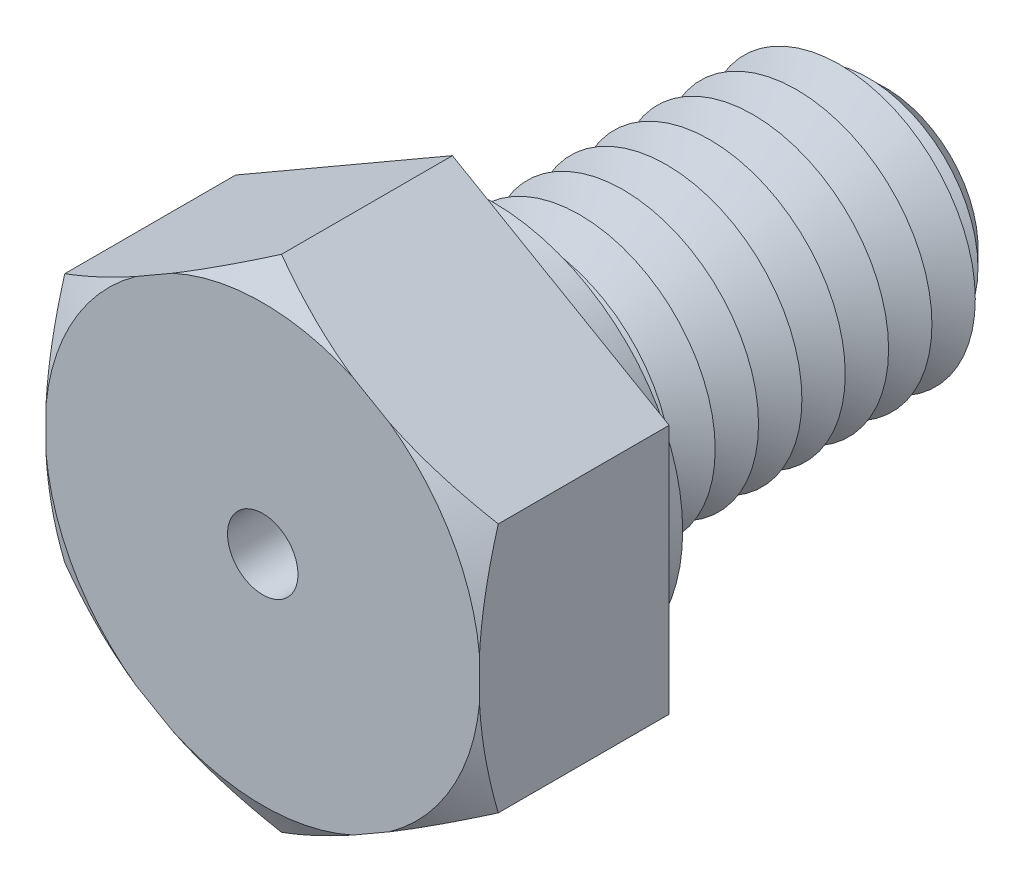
ISO-10303-21;
HEADER;
FILE_DESCRIPTION(('STEP AP214'),'2;1');
FILE_NAME('part.step','',(''),(''),'','','');
FILE_SCHEMA(('AUTOMOTIVE_DESIGN { 1 0 10303 214 1 1 1 1 }'));
ENDSEC;
DATA;
#1=APPLICATION_CONTEXT('core data for automotive mechanical design processes');
#2=APPLICATION_PROTOCOL_DEFINITION('international standard','automotive_design',2000,#1);
#3=PRODUCT_CONTEXT('',#1,'mechanical');
#4=PRODUCT('Part','Part','',(#3));
#5=PRODUCT_RELATED_PRODUCT_CATEGORY('part','',(#4));
#6=PRODUCT_DEFINITION_FORMATION('','',#4);
#7=PRODUCT_DEFINITION_CONTEXT('part definition',#1,'design');
#8=PRODUCT_DEFINITION('design','',#6,#7);
#9=PRODUCT_DEFINITION_SHAPE('','',#8);
#10=(LENGTH_UNIT() NAMED_UNIT(*) SI_UNIT(.MILLI.,.METRE.));
#11=(NAMED_UNIT(*) PLANE_ANGLE_UNIT() SI_UNIT($,.RADIAN.));
#12=(NAMED_UNIT(*) SI_UNIT($,.STERADIAN.) SOLID_ANGLE_UNIT());
#13=UNCERTAINTY_MEASURE_WITH_UNIT(LENGTH_MEASURE(1.E-05),#10,'distance_accuracy_value','');
#14=(GEOMETRIC_REPRESENTATION_CONTEXT(3) GLOBAL_UNCERTAINTY_ASSIGNED_CONTEXT((#13)) GLOBAL_UNIT_ASSIGNED_CONTEXT((#10,
#11,#12)) REPRESENTATION_CONTEXT('',''));
#15=CARTESIAN_POINT('',(0.,0.,0.));
#16=DIRECTION('',(0.,0.,1.));
#17=DIRECTION('',(1.,0.,0.));
#18=AXIS2_PLACEMENT_3D('',#15,#16,#17);
#19=CARTESIAN_POINT('',(4.,2.3094010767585,3.5));
#20=DIRECTION('',(-0.5,-0.866025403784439,0.));
#21=DIRECTION('',(0.866025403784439,-0.5,0.));
#22=AXIS2_PLACEMENT_3D('',#19,#20,#21);
#23=PLANE('',#22);
#24=CARTESIAN_POINT('',(6.77926459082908,0.704791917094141,1.88515125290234));
#25=CARTESIAN_POINT('',(6.65357706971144,0.777357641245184,1.95298106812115));
#26=CARTESIAN_POINT('',(6.52758896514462,0.850096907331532,2.02007962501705));
#27=CARTESIAN_POINT('',(6.2748848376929,0.995995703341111,2.15247084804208));
#28=CARTESIAN_POINT('',(6.14816872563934,1.06915528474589,2.21776328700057));
#29=CARTESIAN_POINT('',(5.8935057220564,1.21618503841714,2.34638757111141));
#30=CARTESIAN_POINT('',(5.76555618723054,1.29005673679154,2.40971246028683));
#31=CARTESIAN_POINT('',(5.50869902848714,1.43835328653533,2.53371033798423));
#32=CARTESIAN_POINT('',(5.37979143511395,1.51277812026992,2.59438341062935));
#33=CARTESIAN_POINT('',(5.11756014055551,1.66417742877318,2.7140043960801));
#34=CARTESIAN_POINT('',(4.98420771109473,1.74116848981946,2.77286873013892));
#35=CARTESIAN_POINT('',(4.7161724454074,1.89591872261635,2.88640197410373));
#36=CARTESIAN_POINT('',(4.58148968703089,1.97367784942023,2.94107112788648));
#37=CARTESIAN_POINT('',(4.31074083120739,2.12999477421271,3.0451841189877));
#38=CARTESIAN_POINT('',(4.17467611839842,2.20855177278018,3.09463271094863));
#39=CARTESIAN_POINT('',(3.90094921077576,2.36658807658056,3.18716064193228));
#40=CARTESIAN_POINT('',(3.76328722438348,2.44606726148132,3.23024080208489));
#41=CARTESIAN_POINT('',(3.43409497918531,2.63612649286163,3.32342391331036));
#42=CARTESIAN_POINT('',(3.24179802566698,2.74714919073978,3.37006382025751));
#43=CARTESIAN_POINT('',(2.95137883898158,2.91482278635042,3.4261412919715));
#44=CARTESIAN_POINT('',(2.85424512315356,2.97090296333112,3.44251989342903));
#45=CARTESIAN_POINT('',(2.65944416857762,3.08337134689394,3.47023794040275));
#46=CARTESIAN_POINT('',(2.56177700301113,3.13975951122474,3.48157806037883));
#47=CARTESIAN_POINT('',(2.36721602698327,3.25208934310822,3.49879538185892));
#48=CARTESIAN_POINT('',(2.27032632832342,3.30802863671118,3.50473421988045));
#49=CARTESIAN_POINT('',(2.07641108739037,3.41998565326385,3.51119583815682));
#50=CARTESIAN_POINT('',(1.97938554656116,3.47600337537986,3.51171867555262));
#51=CARTESIAN_POINT('',(1.78542763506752,3.58798502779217,3.50733170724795));
#52=CARTESIAN_POINT('',(1.68849526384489,3.64394895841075,3.50242193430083));
#53=CARTESIAN_POINT('',(1.49492986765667,3.75570399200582,3.48731840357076));
#54=CARTESIAN_POINT('',(1.39829689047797,3.81149506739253,3.47712384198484));
#55=CARTESIAN_POINT('',(1.1701117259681,3.94323783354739,3.44706969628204));
#56=CARTESIAN_POINT('',(1.03877271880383,4.01906644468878,3.42503535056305));
#57=CARTESIAN_POINT('',(0.777349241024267,4.16999935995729,3.37264454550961));
#58=CARTESIAN_POINT('',(0.64726495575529,4.24510355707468,3.34228687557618));
#59=CARTESIAN_POINT('',(0.388367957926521,4.3945778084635,3.27439527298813));
#60=CARTESIAN_POINT('',(0.259556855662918,4.46894693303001,3.2368532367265));
#61=CARTESIAN_POINT('',(0.00337956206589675,4.61685096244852,3.15577578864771));
#62=CARTESIAN_POINT('',(-0.123986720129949,4.69038591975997,3.11224075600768));
#63=CARTESIAN_POINT('',(-0.378873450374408,4.83754484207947,3.01966290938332));
#64=CARTESIAN_POINT('',(-0.506377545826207,4.91115936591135,2.97056048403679));
#65=CARTESIAN_POINT('',(-0.760034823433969,5.0576084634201,2.86822484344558));
#66=CARTESIAN_POINT('',(-0.886188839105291,5.13044351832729,2.81499436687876));
#67=CARTESIAN_POINT('',(-1.13734672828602,5.27544959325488,2.70513446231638));
#68=CARTESIAN_POINT('',(-1.26235083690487,5.34762074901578,2.6485057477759));
#69=CARTESIAN_POINT('',(-1.5113783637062,5.49139685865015,2.53244390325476));
#70=CARTESIAN_POINT('',(-1.63540176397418,5.56300180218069,2.47301072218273));
#71=CARTESIAN_POINT('',(-1.84520240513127,5.68413025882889,2.37015667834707));
#72=CARTESIAN_POINT('',(-1.93119941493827,5.73378065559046,2.32733101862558));
#73=CARTESIAN_POINT('',(-2.1028145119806,5.83286267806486,2.24068817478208));
#74=CARTESIAN_POINT('',(-2.18843261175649,5.88229431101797,2.19687102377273));
#75=CARTESIAN_POINT('',(-2.3584228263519,5.98043820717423,2.10883190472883));
#76=CARTESIAN_POINT('',(-2.44279852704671,6.02915254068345,2.06461915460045));
#77=CARTESIAN_POINT('',(-2.61124951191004,6.12640776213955,1.97543229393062));
#78=CARTESIAN_POINT('',(-2.6953247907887,6.17494864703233,1.93045817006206));
#79=CARTESIAN_POINT('',(-2.77926459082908,6.22341131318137,1.88515125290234));
#80=B_SPLINE_CURVE_WITH_KNOTS('',3,(#24,#25,#26,#27,#28,#29,#30,#31,#32,#33,#34,#35,#36,#37,#38,
#39,#40,#41,#42,#43,#44,#45,#46,#47,#48,#49,#50,#51,#52,#53,#54,#55,#56,#57,#58,#59,#60,#61,#62,
#63,#64,#65,#66,#67,#68,#69,#70,#71,#72,#73,#74,#75,#76,#77,#78,#79),.UNSPECIFIED.,.F.,.F.,(4,2,
2,2,2,2,2,2,2,2,2,2,2,2,2,2,2,2,2,2,2,2,2,2,2,2,2,4),(0.,0.480604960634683,0.96127009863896,
1.44347608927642,1.92566677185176,2.42016676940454,2.91463799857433,3.4086549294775,
3.9026081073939,4.58254272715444,4.92249867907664,5.26240911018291,5.59839013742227,
5.93436761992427,6.27034307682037,6.60636964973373,7.06584039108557,7.52537799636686,
7.98543702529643,8.44546695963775,8.91099531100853,9.37621741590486,9.84134218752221,
10.3064754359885,10.6308960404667,10.9553058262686,11.2762760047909,11.5972518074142),.UNSPECIFIED.);
#81=CARTESIAN_POINT('',(4.,2.3094010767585,3.15358983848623));
#82=VERTEX_POINT('',#81);
#83=CARTESIAN_POINT('',(2.33627081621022,3.26995556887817,3.5));
#84=VERTEX_POINT('',#83);
#85=EDGE_CURVE('E132',#82,#84,#80,.T.);
#86=ORIENTED_EDGE('',*,*,#85,.F.);
#87=DIRECTION('',(0.,0.,-1.));
#88=VECTOR('',#87,1.);
#89=CARTESIAN_POINT('',(4.,2.3094010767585,3.5));
#90=LINE('',#89,#88);
#91=CARTESIAN_POINT('',(4.,2.3094010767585,0.));
#92=VERTEX_POINT('',#91);
#93=EDGE_CURVE('E144',#82,#92,#90,.T.);
#94=ORIENTED_EDGE('',*,*,#93,.T.);
#95=DIRECTION('',(-0.866025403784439,0.5,0.));
#96=VECTOR('',#95,1.);
#97=CARTESIAN_POINT('',(4.,2.3094010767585,0.));
#98=LINE('',#97,#96);
#99=CARTESIAN_POINT('',(0.,4.618802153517,0.));
#100=VERTEX_POINT('',#99);
#101=EDGE_CURVE('E275',#92,#100,#98,.T.);
#102=ORIENTED_EDGE('',*,*,#101,.T.);
#103=DIRECTION('',(0.,0.,-1.));
#104=VECTOR('',#103,1.);
#105=CARTESIAN_POINT('',(0.,4.618802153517,3.5));
#106=LINE('',#105,#104);
#107=CARTESIAN_POINT('',(0.,4.61880215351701,3.15358983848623));
#108=VERTEX_POINT('',#107);
#109=EDGE_CURVE('E179',#108,#100,#106,.T.);
#110=ORIENTED_EDGE('',*,*,#109,.F.);
#111=CARTESIAN_POINT('',(1.66372918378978,3.65824766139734,3.5));
#112=VERTEX_POINT('',#111);
#113=EDGE_CURVE('E151',#112,#108,#80,.T.);
#114=ORIENTED_EDGE('',*,*,#113,.F.);
#115=DIRECTION('',(-0.866025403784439,0.5,0.));
#116=VECTOR('',#115,1.);
#117=CARTESIAN_POINT('',(4.,2.3094010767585,3.5));
#118=LINE('',#117,#116);
#119=EDGE_CURVE('E148',#84,#112,#118,.T.);
#120=ORIENTED_EDGE('',*,*,#119,.F.);
#121=EDGE_LOOP('',(#86,#94,#102,#110,#114,#120));
#122=FACE_BOUND('',#121,.T.);
#123=ADVANCED_FACE('F39',(#122),#23,.F.);
#124=CARTESIAN_POINT('',(0.,4.618802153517,3.5));
#125=DIRECTION('',(0.5,-0.866025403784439,0.));
#126=DIRECTION('',(0.866025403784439,0.5,0.));
#127=AXIS2_PLACEMENT_3D('',#124,#125,#126);
#128=PLANE('',#127);
#129=CARTESIAN_POINT('',(2.77926459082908,6.22341131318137,1.88515125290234));
#130=CARTESIAN_POINT('',(2.65357706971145,6.15084558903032,1.95298106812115));
#131=CARTESIAN_POINT('',(2.52758896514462,6.07810632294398,2.02007962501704));
#132=CARTESIAN_POINT('',(2.2748848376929,5.9322075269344,2.15247084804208));
#133=CARTESIAN_POINT('',(2.14816872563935,5.85904794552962,2.21776328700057));
#134=CARTESIAN_POINT('',(1.89350572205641,5.71201819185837,2.3463875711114));
#135=CARTESIAN_POINT('',(1.76555618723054,5.63814649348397,2.40971246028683));
#136=CARTESIAN_POINT('',(1.50869902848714,5.48984994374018,2.53371033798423));
#137=CARTESIAN_POINT('',(1.37979143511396,5.41542511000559,2.59438341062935));
#138=CARTESIAN_POINT('',(1.11756014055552,5.26402580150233,2.7140043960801));
#139=CARTESIAN_POINT('',(0.984207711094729,5.18703474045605,2.77286873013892));
#140=CARTESIAN_POINT('',(0.716172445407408,5.03228450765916,2.88640197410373));
#141=CARTESIAN_POINT('',(0.581489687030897,4.95452538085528,2.94107112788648));
#142=CARTESIAN_POINT('',(0.310740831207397,4.7982084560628,3.0451841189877));
#143=CARTESIAN_POINT('',(0.174676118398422,4.71965145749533,3.09463271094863));
#144=CARTESIAN_POINT('',(-0.0990507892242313,4.56161515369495,3.18716064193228));
#145=CARTESIAN_POINT('',(-0.236712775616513,4.48213596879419,3.23024080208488));
#146=CARTESIAN_POINT('',(-0.565905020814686,4.29207673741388,3.32342391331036));
#147=CARTESIAN_POINT('',(-0.758201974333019,4.18105403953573,3.37006382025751));
#148=CARTESIAN_POINT('',(-1.04862116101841,4.01338044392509,3.4261412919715));
#149=CARTESIAN_POINT('',(-1.14575487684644,3.95730026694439,3.44251989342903));
#150=CARTESIAN_POINT('',(-1.34055583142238,3.84483188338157,3.47023794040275));
#151=CARTESIAN_POINT('',(-1.43822299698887,3.78844371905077,3.48157806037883));
#152=CARTESIAN_POINT('',(-1.63278397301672,3.67611388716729,3.49879538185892));
#153=CARTESIAN_POINT('',(-1.72967367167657,3.62017459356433,3.50473421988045));
#154=CARTESIAN_POINT('',(-1.92358891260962,3.50821757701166,3.51119583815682));
#155=CARTESIAN_POINT('',(-2.02061445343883,3.45219985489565,3.51171867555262));
#156=CARTESIAN_POINT('',(-2.21457236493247,3.34021820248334,3.50733170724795));
#157=CARTESIAN_POINT('',(-2.3115047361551,3.28425427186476,3.50242193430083));
#158=CARTESIAN_POINT('',(-2.50507013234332,3.1724992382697,3.48731840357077));
#159=CARTESIAN_POINT('',(-2.60170310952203,3.11670816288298,3.47712384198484));
#160=CARTESIAN_POINT('',(-2.82988827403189,2.98496539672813,3.44706969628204));
#161=CARTESIAN_POINT('',(-2.96122728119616,2.90913678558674,3.42503535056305));
#162=CARTESIAN_POINT('',(-3.22265075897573,2.75820387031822,3.37264454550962));
#163=CARTESIAN_POINT('',(-3.3527350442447,2.68309967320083,3.34228687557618));
#164=CARTESIAN_POINT('',(-3.61163204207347,2.53362542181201,3.27439527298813));
#165=CARTESIAN_POINT('',(-3.74044314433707,2.4592562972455,3.23685323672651));
#166=CARTESIAN_POINT('',(-3.99662043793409,2.311352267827,3.15577578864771));
#167=CARTESIAN_POINT('',(-4.12398672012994,2.23781731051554,3.11224075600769));
#168=CARTESIAN_POINT('',(-4.3788734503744,2.09065838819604,3.01966290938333));
#169=CARTESIAN_POINT('',(-4.5063775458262,2.01704386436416,2.97056048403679));
#170=CARTESIAN_POINT('',(-4.76003482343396,1.87059476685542,2.86822484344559));
#171=CARTESIAN_POINT('',(-4.88618883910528,1.79775971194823,2.81499436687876));
#172=CARTESIAN_POINT('',(-5.13734672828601,1.65275363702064,2.70513446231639));
#173=CARTESIAN_POINT('',(-5.26235083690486,1.58058248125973,2.64850574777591));
#174=CARTESIAN_POINT('',(-5.51137836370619,1.43680637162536,2.53244390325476));
#175=CARTESIAN_POINT('',(-5.63540176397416,1.36520142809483,2.47301072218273));
#176=CARTESIAN_POINT('',(-5.84520240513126,1.24407297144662,2.37015667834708));
#177=CARTESIAN_POINT('',(-5.93119941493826,1.19442257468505,2.32733101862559));
#178=CARTESIAN_POINT('',(-6.1028145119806,1.09534055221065,2.24068817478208));
#179=CARTESIAN_POINT('',(-6.18843261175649,1.04590891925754,2.19687102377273));
#180=CARTESIAN_POINT('',(-6.3584228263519,0.947765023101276,2.10883190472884));
#181=CARTESIAN_POINT('',(-6.44279852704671,0.899050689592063,2.06461915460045));
#182=CARTESIAN_POINT('',(-6.61124951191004,0.80179546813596,1.97543229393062));
#183=CARTESIAN_POINT('',(-6.6953247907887,0.753254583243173,1.93045817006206));
#184=CARTESIAN_POINT('',(-6.77926459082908,0.704791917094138,1.88515125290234));
#185=B_SPLINE_CURVE_WITH_KNOTS('',3,(#129,#130,#131,#132,#133,#134,#135,#136,#137,#138,#139,
#140,#141,#142,#143,#144,#145,#146,#147,#148,#149,#150,#151,#152,#153,#154,#155,#156,#157,#158,
#159,#160,#161,#162,#163,#164,#165,#166,#167,#168,#169,#170,#171,#172,#173,#174,#175,#176,#177,
#178,#179,#180,#181,#182,#183,#184),.UNSPECIFIED.,.F.,.F.,(4,2,2,2,2,2,2,2,2,2,2,2,2,2,2,2,2,2,
2,2,2,2,2,2,2,2,2,4),(0.,0.480604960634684,0.961270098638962,1.44347608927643,1.92566677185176,
2.42016676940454,2.91463799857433,3.4086549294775,3.9026081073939,4.58254272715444,
4.92249867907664,5.26240911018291,5.59839013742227,5.93436761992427,6.27034307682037,
6.60636964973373,7.06584039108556,7.52537799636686,7.98543702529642,8.44546695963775,
8.91099531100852,9.37621741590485,9.8413421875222,10.3064754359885,10.6308960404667,
10.9553058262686,11.2762760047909,11.5972518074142),.UNSPECIFIED.);
#186=CARTESIAN_POINT('',(-1.66372918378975,3.65824766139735,3.5));
#187=VERTEX_POINT('',#186);
#188=EDGE_CURVE('E377',#108,#187,#185,.T.);
#189=ORIENTED_EDGE('',*,*,#188,.F.);
#190=ORIENTED_EDGE('',*,*,#109,.T.);
#191=DIRECTION('',(-0.866025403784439,-0.5,0.));
#192=VECTOR('',#191,1.);
#193=CARTESIAN_POINT('',(0.,4.618802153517,0.));
#194=LINE('',#193,#192);
#195=CARTESIAN_POINT('',(-4.,2.3094010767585,0.));
#196=VERTEX_POINT('',#195);
#197=EDGE_CURVE('E295',#100,#196,#194,.T.);
#198=ORIENTED_EDGE('',*,*,#197,.T.);
#199=DIRECTION('',(0.,0.,-1.));
#200=VECTOR('',#199,1.);
#201=CARTESIAN_POINT('',(-4.,2.3094010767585,3.5));
#202=LINE('',#201,#200);
#203=CARTESIAN_POINT('',(-4.,2.3094010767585,3.15358983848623));
#204=VERTEX_POINT('',#203);
#205=EDGE_CURVE('E176',#204,#196,#202,.T.);
#206=ORIENTED_EDGE('',*,*,#205,.F.);
#207=CARTESIAN_POINT('',(-2.33627081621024,3.26995556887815,3.5));
#208=VERTEX_POINT('',#207);
#209=EDGE_CURVE('E372',#208,#204,#185,.T.);
#210=ORIENTED_EDGE('',*,*,#209,.F.);
#211=DIRECTION('',(-0.866025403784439,-0.5,0.));
#212=VECTOR('',#211,1.);
#213=CARTESIAN_POINT('',(0.,4.618802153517,3.5));
#214=LINE('',#213,#212);
#215=EDGE_CURVE('E278',#187,#208,#214,.T.);
#216=ORIENTED_EDGE('',*,*,#215,.F.);
#217=EDGE_LOOP('',(#189,#190,#198,#206,#210,#216));
#218=FACE_BOUND('',#217,.T.);
#219=ADVANCED_FACE('F366',(#218),#128,.F.);
#220=CARTESIAN_POINT('',(-4.,2.3094010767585,3.5));
#221=DIRECTION('',(1.,0.,0.));
#222=DIRECTION('',(0.,0.,-1.));
#223=AXIS2_PLACEMENT_3D('',#220,#221,#222);
#224=PLANE('',#223);
#225=CARTESIAN_POINT('',(-4.,5.08866566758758,2.08330060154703));
#226=CARTESIAN_POINT('',(-4.,4.94414615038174,2.14888120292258));
#227=CARTESIAN_POINT('',(-4.,4.79923170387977,2.21360759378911));
#228=CARTESIAN_POINT('',(-4.,4.5084433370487,2.34093771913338));
#229=CARTESIAN_POINT('',(-4.,4.36256924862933,2.4035410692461));
#230=CARTESIAN_POINT('',(-4.,4.06913305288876,2.52644280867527));
#231=CARTESIAN_POINT('',(-4.,3.92156644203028,2.58673049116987));
#232=CARTESIAN_POINT('',(-4.,3.62518774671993,2.70415001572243));
#233=CARTESIAN_POINT('',(-4.,3.47637571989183,2.76128200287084));
#234=CARTESIAN_POINT('',(-4.,3.17798204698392,2.87144502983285));
#235=CARTESIAN_POINT('',(-4.,3.02840679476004,2.92449322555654));
#236=CARTESIAN_POINT('',(-4.,2.72767549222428,3.02589725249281));
#237=CARTESIAN_POINT('',(-4.,2.57651933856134,3.07425277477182));
#238=CARTESIAN_POINT('',(-4.,2.12084922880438,3.21062944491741));
#239=CARTESIAN_POINT('',(-4.,1.81364350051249,3.29014850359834));
#240=CARTESIAN_POINT('',(-4.,1.28033133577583,3.39840613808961));
#241=CARTESIAN_POINT('',(-4.,1.05588972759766,3.43514774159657));
#242=CARTESIAN_POINT('',(-4.,0.717455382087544,3.47487260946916));
#243=CARTESIAN_POINT('',(-4.,0.604348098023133,3.48554965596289));
#244=CARTESIAN_POINT('',(-4.,0.377758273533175,3.50148677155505));
#245=CARTESIAN_POINT('',(-4.,0.264275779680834,3.50674748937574));
#246=CARTESIAN_POINT('',(-4.,0.0372413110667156,3.51168400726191));
#247=CARTESIAN_POINT('',(-4.,-0.0763106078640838,3.51136237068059));
#248=CARTESIAN_POINT('',(-4.,-0.303259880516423,3.50515259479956));
#249=CARTESIAN_POINT('',(-4.,-0.416657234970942,3.49926448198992));
#250=CARTESIAN_POINT('',(-4.,-0.643045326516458,3.48210091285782));
#251=CARTESIAN_POINT('',(-4.,-0.756036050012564,3.47082527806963));
#252=CARTESIAN_POINT('',(-4.,-0.981405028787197,3.44321260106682));
#253=CARTESIAN_POINT('',(-4.,-1.09378317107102,3.42687465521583));
#254=CARTESIAN_POINT('',(-4.,-1.54188975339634,3.35219605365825));
#255=CARTESIAN_POINT('',(-4.,-1.87460189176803,3.27522286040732));
#256=CARTESIAN_POINT('',(-4.,-2.36751874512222,3.1379521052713));
#257=CARTESIAN_POINT('',(-4.,-2.53101356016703,3.08847923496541));
#258=CARTESIAN_POINT('',(-4.,-2.85611626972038,2.98363580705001));
#259=CARTESIAN_POINT('',(-4.,-3.01772429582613,2.92826566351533));
#260=CARTESIAN_POINT('',(-4.,-3.34106601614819,2.81212836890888));
#261=CARTESIAN_POINT('',(-4.,-3.50277978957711,2.75130648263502));
#262=CARTESIAN_POINT('',(-4.,-3.82469686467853,2.62576992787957));
#263=CARTESIAN_POINT('',(-4.,-3.98490007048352,2.56105501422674));
#264=CARTESIAN_POINT('',(-4.,-4.30300593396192,2.4289095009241));
#265=CARTESIAN_POINT('',(-4.,-4.46091670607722,2.36149833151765));
#266=CARTESIAN_POINT('',(-4.,-4.7755935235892,2.22415533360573));
#267=CARTESIAN_POINT('',(-4.,-4.93235984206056,2.15422413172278));
#268=CARTESIAN_POINT('',(-4.,-5.08866566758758,2.08330060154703));
#269=B_SPLINE_CURVE_WITH_KNOTS('',3,(#225,#226,#227,#228,#229,#230,#231,#232,#233,#234,#235,
#236,#237,#238,#239,#240,#241,#242,#243,#244,#245,#246,#247,#248,#249,#250,#251,#252,#253,#254,
#255,#256,#257,#258,#259,#260,#261,#262,#263,#264,#265,#266,#267,#268),.UNSPECIFIED.,.F.,.F.,(4,
2,2,2,2,2,2,2,2,2,2,2,2,2,2,2,2,2,2,2,2,4),(0.,0.476116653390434,0.952319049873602,
1.43050831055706,1.90867556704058,2.38470991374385,2.8607755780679,3.81133518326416,
4.49276221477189,4.83347879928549,5.17415457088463,5.51467391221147,5.85519163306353,
6.19572063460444,6.53631045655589,7.5583874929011,8.07079781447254,8.58317218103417,
9.1014378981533,9.61973628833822,10.1348057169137,10.6497479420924),.UNSPECIFIED.);
#270=CARTESIAN_POINT('',(-4.,0.388292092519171,3.5));
#271=VERTEX_POINT('',#270);
#272=EDGE_CURVE('E315',#204,#271,#269,.T.);
#273=ORIENTED_EDGE('',*,*,#272,.F.);
#274=ORIENTED_EDGE('',*,*,#205,.T.);
#275=DIRECTION('',(0.,-1.,0.));
#276=VECTOR('',#275,1.);
#277=CARTESIAN_POINT('',(-4.,2.3094010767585,0.));
#278=LINE('',#277,#276);
#279=CARTESIAN_POINT('',(-4.,-2.3094010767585,0.));
#280=VERTEX_POINT('',#279);
#281=EDGE_CURVE('E299',#196,#280,#278,.T.);
#282=ORIENTED_EDGE('',*,*,#281,.T.);
#283=DIRECTION('',(0.,0.,-1.));
#284=VECTOR('',#283,1.);
#285=CARTESIAN_POINT('',(-4.,-2.3094010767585,3.5));
#286=LINE('',#285,#284);
#287=CARTESIAN_POINT('',(-4.,-2.30940107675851,3.15358983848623));
#288=VERTEX_POINT('',#287);
#289=EDGE_CURVE('E173',#288,#280,#286,.T.);
#290=ORIENTED_EDGE('',*,*,#289,.F.);
#291=CARTESIAN_POINT('',(-4.,-0.388292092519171,3.5));
#292=VERTEX_POINT('',#291);
#293=EDGE_CURVE('E314',#292,#288,#269,.T.);
#294=ORIENTED_EDGE('',*,*,#293,.F.);
#295=DIRECTION('',(0.,-1.,0.));
#296=VECTOR('',#295,1.);
#297=CARTESIAN_POINT('',(-4.,2.3094010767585,3.5));
#298=LINE('',#297,#296);
#299=EDGE_CURVE('E282',#271,#292,#298,.T.);
#300=ORIENTED_EDGE('',*,*,#299,.F.);
#301=EDGE_LOOP('',(#273,#274,#282,#290,#294,#300));
#302=FACE_BOUND('',#301,.T.);
#303=ADVANCED_FACE('F369',(#302),#224,.F.);
#304=CARTESIAN_POINT('',(-4.,-2.3094010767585,3.5));
#305=DIRECTION('',(0.5,0.866025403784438,0.));
#306=DIRECTION('',(-0.866025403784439,0.5,0.));
#307=AXIS2_PLACEMENT_3D('',#304,#305,#306);
#308=PLANE('',#307);
#309=CARTESIAN_POINT('',(-6.77926459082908,-0.704791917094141,1.88515125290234));
#310=CARTESIAN_POINT('',(-6.65357706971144,-0.777357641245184,1.95298106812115));
#311=CARTESIAN_POINT('',(-6.52758896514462,-0.850096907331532,2.02007962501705));
#312=CARTESIAN_POINT('',(-6.2748848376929,-0.995995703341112,2.15247084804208));
#313=CARTESIAN_POINT('',(-6.14816872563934,-1.06915528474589,2.21776328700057));
#314=CARTESIAN_POINT('',(-5.8935057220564,-1.21618503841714,2.34638757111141));
#315=CARTESIAN_POINT('',(-5.76555618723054,-1.29005673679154,2.40971246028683));
#316=CARTESIAN_POINT('',(-5.50869902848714,-1.43835328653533,2.53371033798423));
#317=CARTESIAN_POINT('',(-5.37979143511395,-1.51277812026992,2.59438341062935));
#318=CARTESIAN_POINT('',(-5.11756014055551,-1.66417742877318,2.71400439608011));
#319=CARTESIAN_POINT('',(-4.98420771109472,-1.74116848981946,2.77286873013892));
#320=CARTESIAN_POINT('',(-4.7161724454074,-1.89591872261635,2.88640197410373));
#321=CARTESIAN_POINT('',(-4.58148968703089,-1.97367784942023,2.94107112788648));
#322=CARTESIAN_POINT('',(-4.31074083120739,-2.12999477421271,3.0451841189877));
#323=CARTESIAN_POINT('',(-4.17467611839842,-2.20855177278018,3.09463271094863));
#324=CARTESIAN_POINT('',(-3.90094921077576,-2.36658807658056,3.18716064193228));
#325=CARTESIAN_POINT('',(-3.76328722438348,-2.44606726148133,3.23024080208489));
#326=CARTESIAN_POINT('',(-3.43409497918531,-2.63612649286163,3.32342391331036));
#327=CARTESIAN_POINT('',(-3.24179802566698,-2.74714919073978,3.3700638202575));
#328=CARTESIAN_POINT('',(-2.95137883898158,-2.91482278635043,3.4261412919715));
#329=CARTESIAN_POINT('',(-2.85424512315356,-2.97090296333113,3.44251989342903));
#330=CARTESIAN_POINT('',(-2.65944416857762,-3.08337134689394,3.47023794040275));
#331=CARTESIAN_POINT('',(-2.56177700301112,-3.13975951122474,3.48157806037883));
#332=CARTESIAN_POINT('',(-2.36721602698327,-3.25208934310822,3.49879538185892));
#333=CARTESIAN_POINT('',(-2.27032632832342,-3.30802863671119,3.50473421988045));
#334=CARTESIAN_POINT('',(-2.07641108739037,-3.41998565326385,3.51119583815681));
#335=CARTESIAN_POINT('',(-1.97938554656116,-3.47600337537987,3.51171867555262));
#336=CARTESIAN_POINT('',(-1.78542763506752,-3.58798502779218,3.50733170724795));
#337=CARTESIAN_POINT('',(-1.68849526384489,-3.64394895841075,3.50242193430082));
#338=CARTESIAN_POINT('',(-1.49492986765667,-3.75570399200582,3.48731840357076));
#339=CARTESIAN_POINT('',(-1.39829689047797,-3.81149506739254,3.47712384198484));
#340=CARTESIAN_POINT('',(-1.1701117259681,-3.94323783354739,3.44706969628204));
#341=CARTESIAN_POINT('',(-1.03877271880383,-4.01906644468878,3.42503535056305));
#342=CARTESIAN_POINT('',(-0.777349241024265,-4.1699993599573,3.37264454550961));
#343=CARTESIAN_POINT('',(-0.647264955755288,-4.24510355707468,3.34228687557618));
#344=CARTESIAN_POINT('',(-0.388367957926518,-4.39457780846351,3.27439527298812));
#345=CARTESIAN_POINT('',(-0.259556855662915,-4.46894693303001,3.2368532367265));
#346=CARTESIAN_POINT('',(-0.00337956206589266,-4.61685096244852,3.1557757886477));
#347=CARTESIAN_POINT('',(0.123986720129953,-4.69038591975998,3.11224075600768));
#348=CARTESIAN_POINT('',(0.378873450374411,-4.83754484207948,3.01966290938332));
#349=CARTESIAN_POINT('',(0.50637754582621,-4.91115936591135,2.97056048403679));
#350=CARTESIAN_POINT('',(0.760034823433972,-5.0576084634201,2.86822484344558));
#351=CARTESIAN_POINT('',(0.886188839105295,-5.13044351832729,2.81499436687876));
#352=CARTESIAN_POINT('',(1.13734672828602,-5.27544959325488,2.70513446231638));
#353=CARTESIAN_POINT('',(1.26235083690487,-5.34762074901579,2.6485057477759));
#354=CARTESIAN_POINT('',(1.5113783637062,-5.49139685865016,2.53244390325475));
#355=CARTESIAN_POINT('',(1.63540176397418,-5.56300180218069,2.47301072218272));
#356=CARTESIAN_POINT('',(1.84520240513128,-5.6841302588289,2.37015667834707));
#357=CARTESIAN_POINT('',(1.93119941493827,-5.73378065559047,2.32733101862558));
#358=CARTESIAN_POINT('',(2.10281451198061,-5.83286267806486,2.24068817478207));
#359=CARTESIAN_POINT('',(2.1884326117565,-5.88229431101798,2.19687102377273));
#360=CARTESIAN_POINT('',(2.3584228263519,-5.98043820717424,2.10883190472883));
#361=CARTESIAN_POINT('',(2.44279852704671,-6.02915254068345,2.06461915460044));
#362=CARTESIAN_POINT('',(2.61124951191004,-6.12640776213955,1.97543229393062));
#363=CARTESIAN_POINT('',(2.6953247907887,-6.17494864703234,1.93045817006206));
#364=CARTESIAN_POINT('',(2.77926459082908,-6.22341131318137,1.88515125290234));
#365=B_SPLINE_CURVE_WITH_KNOTS('',3,(#309,#310,#311,#312,#313,#314,#315,#316,#317,#318,#319,
#320,#321,#322,#323,#324,#325,#326,#327,#328,#329,#330,#331,#332,#333,#334,#335,#336,#337,#338,
#339,#340,#341,#342,#343,#344,#345,#346,#347,#348,#349,#350,#351,#352,#353,#354,#355,#356,#357,
#358,#359,#360,#361,#362,#363,#364),.UNSPECIFIED.,.F.,.F.,(4,2,2,2,2,2,2,2,2,2,2,2,2,2,2,2,2,2,
2,2,2,2,2,2,2,2,2,4),(0.,0.480604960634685,0.961270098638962,1.44347608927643,1.92566677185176,
2.42016676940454,2.91463799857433,3.4086549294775,3.90260810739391,4.58254272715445,
4.92249867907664,5.26240911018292,5.59839013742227,5.93436761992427,6.27034307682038,
6.60636964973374,7.06584039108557,7.52537799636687,7.98543702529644,8.44546695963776,
8.91099531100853,9.37621741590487,9.84134218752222,10.3064754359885,10.6308960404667,
10.9553058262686,11.2762760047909,11.5972518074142),.UNSPECIFIED.);
#366=CARTESIAN_POINT('',(-2.3362708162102,-3.26995556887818,3.5));
#367=VERTEX_POINT('',#366);
#368=EDGE_CURVE('E316',#288,#367,#365,.T.);
#369=ORIENTED_EDGE('',*,*,#368,.F.);
#370=ORIENTED_EDGE('',*,*,#289,.T.);
#371=DIRECTION('',(0.866025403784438,-0.5,0.));
#372=VECTOR('',#371,1.);
#373=CARTESIAN_POINT('',(-4.,-2.3094010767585,0.));
#374=LINE('',#373,#372);
#375=CARTESIAN_POINT('',(0.,-4.61880215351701,0.));
#376=VERTEX_POINT('',#375);
#377=EDGE_CURVE('E303',#280,#376,#374,.T.);
#378=ORIENTED_EDGE('',*,*,#377,.T.);
#379=DIRECTION('',(0.,0.,-1.));
#380=VECTOR('',#379,1.);
#381=CARTESIAN_POINT('',(0.,-4.61880215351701,3.5));
#382=LINE('',#381,#380);
#383=CARTESIAN_POINT('',(0.,-4.618802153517,3.15358983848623));
#384=VERTEX_POINT('',#383);
#385=EDGE_CURVE('E163',#384,#376,#382,.T.);
#386=ORIENTED_EDGE('',*,*,#385,.F.);
#387=CARTESIAN_POINT('',(-1.6637291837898,-3.65824766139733,3.5));
#388=VERTEX_POINT('',#387);
#389=EDGE_CURVE('E318',#388,#384,#365,.T.);
#390=ORIENTED_EDGE('',*,*,#389,.F.);
#391=DIRECTION('',(0.866025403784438,-0.5,0.));
#392=VECTOR('',#391,1.);
#393=CARTESIAN_POINT('',(-4.,-2.3094010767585,3.5));
#394=LINE('',#393,#392);
#395=EDGE_CURVE('E286',#367,#388,#394,.T.);
#396=ORIENTED_EDGE('',*,*,#395,.F.);
#397=EDGE_LOOP('',(#369,#370,#378,#386,#390,#396));
#398=FACE_BOUND('',#397,.T.);
#399=ADVANCED_FACE('F338',(#398),#308,.F.);
#400=CARTESIAN_POINT('',(0.,-4.61880215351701,3.5));
#401=DIRECTION('',(-0.5,0.866025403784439,0.));
#402=DIRECTION('',(-0.866025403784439,-0.5,0.));
#403=AXIS2_PLACEMENT_3D('',#400,#401,#402);
#404=PLANE('',#403);
#405=CARTESIAN_POINT('',(-2.77926459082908,-6.22341131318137,1.88515125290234));
#406=CARTESIAN_POINT('',(-2.65357706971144,-6.15084558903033,1.95298106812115));
#407=CARTESIAN_POINT('',(-2.52758896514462,-6.07810632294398,2.02007962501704));
#408=CARTESIAN_POINT('',(-2.2748848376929,-5.9322075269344,2.15247084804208));
#409=CARTESIAN_POINT('',(-2.14816872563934,-5.85904794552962,2.21776328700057));
#410=CARTESIAN_POINT('',(-1.8935057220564,-5.71201819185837,2.3463875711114));
#411=CARTESIAN_POINT('',(-1.76555618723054,-5.63814649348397,2.40971246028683));
#412=CARTESIAN_POINT('',(-1.50869902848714,-5.48984994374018,2.53371033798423));
#413=CARTESIAN_POINT('',(-1.37979143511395,-5.41542511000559,2.59438341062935));
#414=CARTESIAN_POINT('',(-1.11756014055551,-5.26402580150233,2.7140043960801));
#415=CARTESIAN_POINT('',(-0.984207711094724,-5.18703474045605,2.77286873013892));
#416=CARTESIAN_POINT('',(-0.716172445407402,-5.03228450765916,2.88640197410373));
#417=CARTESIAN_POINT('',(-0.581489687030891,-4.95452538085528,2.94107112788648));
#418=CARTESIAN_POINT('',(-0.310740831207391,-4.7982084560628,3.0451841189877));
#419=CARTESIAN_POINT('',(-0.174676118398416,-4.71965145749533,3.09463271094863));
#420=CARTESIAN_POINT('',(0.0990507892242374,-4.56161515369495,3.18716064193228));
#421=CARTESIAN_POINT('',(0.236712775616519,-4.48213596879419,3.23024080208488));
#422=CARTESIAN_POINT('',(0.565905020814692,-4.29207673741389,3.32342391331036));
#423=CARTESIAN_POINT('',(0.758201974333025,-4.18105403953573,3.37006382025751));
#424=CARTESIAN_POINT('',(1.04862116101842,-4.01338044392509,3.4261412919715));
#425=CARTESIAN_POINT('',(1.14575487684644,-3.95730026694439,3.44251989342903));
#426=CARTESIAN_POINT('',(1.34055583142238,-3.84483188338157,3.47023794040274));
#427=CARTESIAN_POINT('',(1.43822299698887,-3.78844371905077,3.48157806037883));
#428=CARTESIAN_POINT('',(1.63278397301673,-3.67611388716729,3.49879538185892));
#429=CARTESIAN_POINT('',(1.72967367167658,-3.62017459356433,3.50473421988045));
#430=CARTESIAN_POINT('',(1.92358891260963,-3.50821757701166,3.51119583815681));
#431=CARTESIAN_POINT('',(2.02061445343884,-3.45219985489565,3.51171867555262));
#432=CARTESIAN_POINT('',(2.21457236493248,-3.34021820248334,3.50733170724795));
#433=CARTESIAN_POINT('',(2.31150473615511,-3.28425427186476,3.50242193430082));
#434=CARTESIAN_POINT('',(2.50507013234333,-3.1724992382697,3.48731840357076));
#435=CARTESIAN_POINT('',(2.60170310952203,-3.11670816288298,3.47712384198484));
#436=CARTESIAN_POINT('',(2.8298882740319,-2.98496539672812,3.44706969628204));
#437=CARTESIAN_POINT('',(2.96122728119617,-2.90913678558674,3.42503535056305));
#438=CARTESIAN_POINT('',(3.22265075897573,-2.75820387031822,3.37264454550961));
#439=CARTESIAN_POINT('',(3.35273504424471,-2.68309967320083,3.34228687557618));
#440=CARTESIAN_POINT('',(3.61163204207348,-2.53362542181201,3.27439527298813));
#441=CARTESIAN_POINT('',(3.74044314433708,-2.4592562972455,3.2368532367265));
#442=CARTESIAN_POINT('',(3.99662043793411,-2.31135226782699,3.15577578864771));
#443=CARTESIAN_POINT('',(4.12398672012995,-2.23781731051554,3.11224075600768));
#444=CARTESIAN_POINT('',(4.37887345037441,-2.09065838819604,3.01966290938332));
#445=CARTESIAN_POINT('',(4.50637754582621,-2.01704386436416,2.97056048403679));
#446=CARTESIAN_POINT('',(4.76003482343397,-1.87059476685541,2.86822484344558));
#447=CARTESIAN_POINT('',(4.8861888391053,-1.79775971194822,2.81499436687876));
#448=CARTESIAN_POINT('',(5.13734672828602,-1.65275363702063,2.70513446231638));
#449=CARTESIAN_POINT('',(5.26235083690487,-1.58058248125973,2.6485057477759));
#450=CARTESIAN_POINT('',(5.5113783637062,-1.43680637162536,2.53244390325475));
#451=CARTESIAN_POINT('',(5.63540176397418,-1.36520142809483,2.47301072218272));
#452=CARTESIAN_POINT('',(5.84520240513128,-1.24407297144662,2.37015667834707));
#453=CARTESIAN_POINT('',(5.93119941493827,-1.19442257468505,2.32733101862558));
#454=CARTESIAN_POINT('',(6.1028145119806,-1.09534055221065,2.24068817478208));
#455=CARTESIAN_POINT('',(6.1884326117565,-1.04590891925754,2.19687102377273));
#456=CARTESIAN_POINT('',(6.3584228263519,-0.947765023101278,2.10883190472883));
#457=CARTESIAN_POINT('',(6.44279852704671,-0.899050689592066,2.06461915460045));
#458=CARTESIAN_POINT('',(6.61124951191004,-0.801795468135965,1.97543229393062));
#459=CARTESIAN_POINT('',(6.6953247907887,-0.753254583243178,1.93045817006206));
#460=CARTESIAN_POINT('',(6.77926459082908,-0.704791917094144,1.88515125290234));
#461=B_SPLINE_CURVE_WITH_KNOTS('',3,(#405,#406,#407,#408,#409,#410,#411,#412,#413,#414,#415,
#416,#417,#418,#419,#420,#421,#422,#423,#424,#425,#426,#427,#428,#429,#430,#431,#432,#433,#434,
#435,#436,#437,#438,#439,#440,#441,#442,#443,#444,#445,#446,#447,#448,#449,#450,#451,#452,#453,
#454,#455,#456,#457,#458,#459,#460),.UNSPECIFIED.,.F.,.F.,(4,2,2,2,2,2,2,2,2,2,2,2,2,2,2,2,2,2,
2,2,2,2,2,2,2,2,2,4),(0.,0.480604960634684,0.961270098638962,1.44347608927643,1.92566677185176,
2.42016676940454,2.91463799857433,3.4086549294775,3.90260810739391,4.58254272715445,
4.92249867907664,5.26240911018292,5.59839013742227,5.93436761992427,6.27034307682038,
6.60636964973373,7.06584039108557,7.52537799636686,7.98543702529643,8.44546695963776,
8.91099531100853,9.37621741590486,9.84134218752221,10.3064754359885,10.6308960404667,
10.9553058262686,11.2762760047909,11.5972518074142),.UNSPECIFIED.);
#462=CARTESIAN_POINT('',(1.6637291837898,-3.65824766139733,3.5));
#463=VERTEX_POINT('',#462);
#464=EDGE_CURVE('E64',#384,#463,#461,.T.);
#465=ORIENTED_EDGE('',*,*,#464,.F.);
#466=ORIENTED_EDGE('',*,*,#385,.T.);
#467=DIRECTION('',(0.866025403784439,0.5,0.));
#468=VECTOR('',#467,1.);
#469=CARTESIAN_POINT('',(0.,-4.61880215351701,0.));
#470=LINE('',#469,#468);
#471=CARTESIAN_POINT('',(4.,-2.30940107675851,0.));
#472=VERTEX_POINT('',#471);
#473=EDGE_CURVE('E306',#376,#472,#470,.T.);
#474=ORIENTED_EDGE('',*,*,#473,.T.);
#475=DIRECTION('',(0.,0.,-1.));
#476=VECTOR('',#475,1.);
#477=CARTESIAN_POINT('',(4.,-2.30940107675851,3.5));
#478=LINE('',#477,#476);
#479=CARTESIAN_POINT('',(4.,-2.3094010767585,3.15358983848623));
#480=VERTEX_POINT('',#479);
#481=EDGE_CURVE('E157',#480,#472,#478,.T.);
#482=ORIENTED_EDGE('',*,*,#481,.F.);
#483=CARTESIAN_POINT('',(2.3362708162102,-3.26995556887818,3.5));
#484=VERTEX_POINT('',#483);
#485=EDGE_CURVE('E323',#484,#480,#461,.T.);
#486=ORIENTED_EDGE('',*,*,#485,.F.);
#487=DIRECTION('',(0.866025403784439,0.5,0.));
#488=VECTOR('',#487,1.);
#489=CARTESIAN_POINT('',(0.,-4.61880215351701,3.5));
#490=LINE('',#489,#488);
#491=EDGE_CURVE('E166',#463,#484,#490,.T.);
#492=ORIENTED_EDGE('',*,*,#491,.F.);
#493=EDGE_LOOP('',(#465,#466,#474,#482,#486,#492));
#494=FACE_BOUND('',#493,.T.);
#495=ADVANCED_FACE('F409',(#494),#404,.F.);
#496=CARTESIAN_POINT('',(4.,-2.30940107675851,3.5));
#497=DIRECTION('',(-1.,0.,0.));
#498=DIRECTION('',(0.,0.,1.));
#499=AXIS2_PLACEMENT_3D('',#496,#497,#498);
#500=PLANE('',#499);
#501=CARTESIAN_POINT('',(4.,-5.08866566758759,2.08330060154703));
#502=CARTESIAN_POINT('',(4.,-4.94414615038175,2.14888120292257));
#503=CARTESIAN_POINT('',(4.,-4.79923170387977,2.21360759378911));
#504=CARTESIAN_POINT('',(4.,-4.50844333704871,2.34093771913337));
#505=CARTESIAN_POINT('',(4.,-4.36256924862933,2.40354106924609));
#506=CARTESIAN_POINT('',(4.,-4.06913305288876,2.52644280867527));
#507=CARTESIAN_POINT('',(4.,-3.92156644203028,2.58673049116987));
#508=CARTESIAN_POINT('',(4.,-3.62518774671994,2.70415001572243));
#509=CARTESIAN_POINT('',(4.,-3.47637571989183,2.76128200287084));
#510=CARTESIAN_POINT('',(4.,-3.17798204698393,2.87144502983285));
#511=CARTESIAN_POINT('',(4.,-3.02840679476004,2.92449322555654));
#512=CARTESIAN_POINT('',(4.,-2.72767549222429,3.02589725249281));
#513=CARTESIAN_POINT('',(4.,-2.57651933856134,3.07425277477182));
#514=CARTESIAN_POINT('',(4.,-2.12084922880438,3.21062944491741));
#515=CARTESIAN_POINT('',(4.,-1.8136435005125,3.29014850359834));
#516=CARTESIAN_POINT('',(4.,-1.28033133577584,3.39840613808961));
#517=CARTESIAN_POINT('',(4.,-1.05588972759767,3.43514774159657));
#518=CARTESIAN_POINT('',(4.,-0.71745538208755,3.47487260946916));
#519=CARTESIAN_POINT('',(4.,-0.604348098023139,3.48554965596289));
#520=CARTESIAN_POINT('',(4.,-0.377758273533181,3.50148677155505));
#521=CARTESIAN_POINT('',(4.,-0.264275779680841,3.50674748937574));
#522=CARTESIAN_POINT('',(4.,-0.0372413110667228,3.51168400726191));
#523=CARTESIAN_POINT('',(4.,0.0763106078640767,3.51136237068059));
#524=CARTESIAN_POINT('',(4.,0.303259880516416,3.50515259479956));
#525=CARTESIAN_POINT('',(4.,0.416657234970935,3.49926448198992));
#526=CARTESIAN_POINT('',(4.,0.643045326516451,3.48210091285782));
#527=CARTESIAN_POINT('',(4.,0.756036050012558,3.47082527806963));
#528=CARTESIAN_POINT('',(4.,0.98140502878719,3.44321260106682));
#529=CARTESIAN_POINT('',(4.,1.09378317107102,3.42687465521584));
#530=CARTESIAN_POINT('',(4.,1.54188975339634,3.35219605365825));
#531=CARTESIAN_POINT('',(4.,1.87460189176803,3.27522286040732));
#532=CARTESIAN_POINT('',(4.,2.36751874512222,3.1379521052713));
#533=CARTESIAN_POINT('',(4.,2.53101356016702,3.08847923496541));
#534=CARTESIAN_POINT('',(4.,2.85611626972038,2.98363580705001));
#535=CARTESIAN_POINT('',(4.,3.01772429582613,2.92826566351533));
#536=CARTESIAN_POINT('',(4.,3.34106601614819,2.81212836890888));
#537=CARTESIAN_POINT('',(4.,3.50277978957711,2.75130648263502));
#538=CARTESIAN_POINT('',(4.,3.82469686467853,2.62576992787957));
#539=CARTESIAN_POINT('',(4.,3.98490007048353,2.56105501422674));
#540=CARTESIAN_POINT('',(4.,4.30300593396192,2.4289095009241));
#541=CARTESIAN_POINT('',(4.,4.46091670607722,2.36149833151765));
#542=CARTESIAN_POINT('',(4.,4.7755935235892,2.22415533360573));
#543=CARTESIAN_POINT('',(4.,4.93235984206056,2.15422413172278));
#544=CARTESIAN_POINT('',(4.,5.08866566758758,2.08330060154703));
#545=B_SPLINE_CURVE_WITH_KNOTS('',3,(#501,#502,#503,#504,#505,#506,#507,#508,#509,#510,#511,
#512,#513,#514,#515,#516,#517,#518,#519,#520,#521,#522,#523,#524,#525,#526,#527,#528,#529,#530,
#531,#532,#533,#534,#535,#536,#537,#538,#539,#540,#541,#542,#543,#544),.UNSPECIFIED.,.F.,.F.,(4,
2,2,2,2,2,2,2,2,2,2,2,2,2,2,2,2,2,2,2,2,4),(0.,0.476116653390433,0.952319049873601,
1.43050831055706,1.90867556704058,2.38470991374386,2.8607755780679,3.81133518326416,
4.49276221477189,4.83347879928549,5.17415457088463,5.51467391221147,5.85519163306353,
6.19572063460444,6.53631045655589,7.5583874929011,8.07079781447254,8.58317218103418,
9.10143789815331,9.61973628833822,10.1348057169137,10.6497479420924),.UNSPECIFIED.);
#546=CARTESIAN_POINT('',(4.,-0.388292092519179,3.5));
#547=VERTEX_POINT('',#546);
#548=EDGE_CURVE('E56',#480,#547,#545,.T.);
#549=ORIENTED_EDGE('',*,*,#548,.F.);
#550=ORIENTED_EDGE('',*,*,#481,.T.);
#551=DIRECTION('',(0.,1.,0.));
#552=VECTOR('',#551,1.);
#553=CARTESIAN_POINT('',(4.,-2.30940107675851,0.));
#554=LINE('',#553,#552);
#555=EDGE_CURVE('E154',#472,#92,#554,.T.);
#556=ORIENTED_EDGE('',*,*,#555,.T.);
#557=ORIENTED_EDGE('',*,*,#93,.F.);
#558=CARTESIAN_POINT('',(4.,0.388292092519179,3.5));
#559=VERTEX_POINT('',#558);
#560=EDGE_CURVE('E129',#559,#82,#545,.T.);
#561=ORIENTED_EDGE('',*,*,#560,.F.);
#562=DIRECTION('',(0.,1.,0.));
#563=VECTOR('',#562,1.);
#564=CARTESIAN_POINT('',(4.,-2.30940107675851,3.5));
#565=LINE('',#564,#563);
#566=EDGE_CURVE('E158',#547,#559,#565,.T.);
#567=ORIENTED_EDGE('',*,*,#566,.F.);
#568=EDGE_LOOP('',(#549,#550,#556,#557,#561,#567));
#569=FACE_BOUND('',#568,.T.);
#570=ADVANCED_FACE('F152',(#569),#500,.F.);
#571=CARTESIAN_POINT('',(0.,0.,3.5));
#572=DIRECTION('',(0.,0.,1.));
#573=DIRECTION('',(1.,0.,0.));
#574=AXIS2_PLACEMENT_3D('',#571,#572,#573);
#575=PLANE('',#574);
#576=CARTESIAN_POINT('',(0.,0.,3.5));
#577=DIRECTION('',(0.,0.,1.));
#578=DIRECTION('',(1.,0.,0.));
#579=AXIS2_PLACEMENT_3D('',#576,#577,#578);
#580=CIRCLE('',#579,0.65);
#581=CARTESIAN_POINT('',(0.65,0.,3.5));
#582=VERTEX_POINT('',#581);
#583=EDGE_CURVE('E429',#582,#582,#580,.T.);
#584=ORIENTED_EDGE('',*,*,#583,.F.);
#585=EDGE_LOOP('',(#584));
#586=FACE_BOUND('',#585,.T.);
#587=ORIENTED_EDGE('',*,*,#566,.T.);
#588=CARTESIAN_POINT('',(0.,0.,3.5));
#589=DIRECTION('',(0.,0.,1.));
#590=DIRECTION('',(1.,0.,0.));
#591=AXIS2_PLACEMENT_3D('',#588,#589,#590);
#592=CIRCLE('',#591,4.018802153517);
#593=EDGE_CURVE('E134',#559,#84,#592,.T.);
#594=ORIENTED_EDGE('',*,*,#593,.T.);
#595=ORIENTED_EDGE('',*,*,#119,.T.);
#596=CARTESIAN_POINT('',(0.,0.,3.5));
#597=DIRECTION('',(0.,0.,1.));
#598=DIRECTION('',(1.,0.,0.));
#599=AXIS2_PLACEMENT_3D('',#596,#597,#598);
#600=CIRCLE('',#599,4.018802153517);
#601=EDGE_CURVE('E11',#112,#187,#600,.T.);
#602=ORIENTED_EDGE('',*,*,#601,.T.);
#603=ORIENTED_EDGE('',*,*,#215,.T.);
#604=EDGE_CURVE('E49',#208,#271,#600,.T.);
#605=ORIENTED_EDGE('',*,*,#604,.T.);
#606=ORIENTED_EDGE('',*,*,#299,.T.);
#607=EDGE_CURVE('E393',#292,#367,#600,.T.);
#608=ORIENTED_EDGE('',*,*,#607,.T.);
#609=ORIENTED_EDGE('',*,*,#395,.T.);
#610=EDGE_CURVE('E402',#388,#463,#600,.T.);
#611=ORIENTED_EDGE('',*,*,#610,.T.);
#612=ORIENTED_EDGE('',*,*,#491,.T.);
#613=EDGE_CURVE('E43',#484,#547,#600,.T.);
#614=ORIENTED_EDGE('',*,*,#613,.T.);
#615=EDGE_LOOP('',(#587,#594,#595,#602,#603,#605,#606,#608,#609,#611,#612,#614));
#616=FACE_BOUND('',#615,.T.);
#617=ADVANCED_FACE('F389',(#586,#616),#575,.T.);
#618=CARTESIAN_POINT('',(0.,0.,0.));
#619=DIRECTION('',(0.,0.,1.));
#620=DIRECTION('',(1.,0.,0.));
#621=AXIS2_PLACEMENT_3D('',#618,#619,#620);
#622=PLANE('',#621);
#623=CARTESIAN_POINT('',(0.,0.,0.));
#624=DIRECTION('',(0.,0.,1.));
#625=DIRECTION('',(1.,0.,0.));
#626=AXIS2_PLACEMENT_3D('',#623,#624,#625);
#627=CIRCLE('',#626,3.5);
#628=CARTESIAN_POINT('',(3.5,0.,0.));
#629=VERTEX_POINT('',#628);
#630=EDGE_CURVE('E182',#629,#629,#627,.F.);
#631=ORIENTED_EDGE('',*,*,#630,.F.);
#632=EDGE_LOOP('',(#631));
#633=FACE_BOUND('',#632,.T.);
#634=ORIENTED_EDGE('',*,*,#101,.F.);
#635=ORIENTED_EDGE('',*,*,#555,.F.);
#636=ORIENTED_EDGE('',*,*,#473,.F.);
#637=ORIENTED_EDGE('',*,*,#377,.F.);
#638=ORIENTED_EDGE('',*,*,#281,.F.);
#639=ORIENTED_EDGE('',*,*,#197,.F.);
#640=EDGE_LOOP('',(#634,#635,#636,#637,#638,#639));
#641=FACE_BOUND('',#640,.T.);
#642=ADVANCED_FACE('F442',(#633,#641),#622,.F.);
#643=CARTESIAN_POINT('',(0.,0.,-0.75));
#644=DIRECTION('',(0.,0.,1.));
#645=DIRECTION('',(1.,0.,0.));
#646=AXIS2_PLACEMENT_3D('',#643,#644,#645);
#647=CYLINDRICAL_SURFACE('',#646,3.5);
#648=CARTESIAN_POINT('',(0.,0.,-0.75));
#649=DIRECTION('',(0.,0.,-1.));
#650=DIRECTION('',(-1.,0.,0.));
#651=AXIS2_PLACEMENT_3D('',#648,#649,#650);
#652=CIRCLE('',#651,3.5);
#653=CARTESIAN_POINT('',(-3.5,0.,-0.75));
#654=VERTEX_POINT('',#653);
#655=EDGE_CURVE('E271',#654,#654,#652,.T.);
#656=ORIENTED_EDGE('',*,*,#655,.F.);
#657=EDGE_LOOP('',(#656));
#658=FACE_BOUND('',#657,.T.);
#659=ORIENTED_EDGE('',*,*,#630,.T.);
#660=EDGE_LOOP('',(#659));
#661=FACE_BOUND('',#660,.T.);
#662=ADVANCED_FACE('F446',(#658,#661),#647,.T.);
#663=CARTESIAN_POINT('',(0.,0.,-0.75));
#664=DIRECTION('',(0.,0.,-1.));
#665=DIRECTION('',(-1.,0.,0.));
#666=AXIS2_PLACEMENT_3D('',#663,#664,#665);
#667=PLANE('',#666);
#668=CARTESIAN_POINT('',(0.,0.,-0.75));
#669=DIRECTION('',(0.,0.,1.));
#670=DIRECTION('',(1.,0.,0.));
#671=AXIS2_PLACEMENT_3D('',#668,#669,#670);
#672=CIRCLE('',#671,2.5);
#673=CARTESIAN_POINT('',(2.5,0.,-0.75));
#674=VERTEX_POINT('',#673);
#675=EDGE_CURVE('E267',#674,#674,#672,.T.);
#676=ORIENTED_EDGE('',*,*,#675,.T.);
#677=EDGE_LOOP('',(#676));
#678=FACE_BOUND('',#677,.T.);
#679=ORIENTED_EDGE('',*,*,#655,.T.);
#680=EDGE_LOOP('',(#679));
#681=FACE_BOUND('',#680,.T.);
#682=ADVANCED_FACE('F453',(#678,#681),#667,.T.);
#683=CARTESIAN_POINT('',(0.,0.,-0.75));
#684=DIRECTION('',(0.,0.,1.));
#685=DIRECTION('',(1.,0.,0.));
#686=AXIS2_PLACEMENT_3D('',#683,#684,#685);
#687=CONICAL_SURFACE('',#686,2.5,1.0471975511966);
#688=CARTESIAN_POINT('',(0.,0.,-1.15));
#689=DIRECTION('',(0.,0.,1.));
#690=DIRECTION('',(1.,0.,0.));
#691=AXIS2_PLACEMENT_3D('',#688,#689,#690);
#692=CIRCLE('',#691,1.80717967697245);
#693=CARTESIAN_POINT('',(1.80717967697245,0.,-1.15));
#694=VERTEX_POINT('',#693);
#695=EDGE_CURVE('E263',#694,#694,#692,.T.);
#696=ORIENTED_EDGE('',*,*,#695,.T.);
#697=EDGE_LOOP('',(#696));
#698=FACE_BOUND('',#697,.T.);
#699=ORIENTED_EDGE('',*,*,#675,.F.);
#700=EDGE_LOOP('',(#699));
#701=FACE_BOUND('',#700,.T.);
#702=ADVANCED_FACE('F714',(#698,#701),#687,.T.);
#703=CARTESIAN_POINT('',(0.,0.,-1.15));
#704=DIRECTION('',(0.,0.,-1.));
#705=DIRECTION('',(-1.,0.,0.));
#706=AXIS2_PLACEMENT_3D('',#703,#704,#705);
#707=CONICAL_SURFACE('',#706,1.80717967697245,1.0471975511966);
#708=CARTESIAN_POINT('',(0.,0.,-1.55));
#709=DIRECTION('',(0.,0.,1.));
#710=DIRECTION('',(1.,0.,0.));
#711=AXIS2_PLACEMENT_3D('',#708,#709,#710);
#712=CIRCLE('',#711,2.5);
#713=CARTESIAN_POINT('',(2.5,0.,-1.55));
#714=VERTEX_POINT('',#713);
#715=EDGE_CURVE('E260',#714,#714,#712,.T.);
#716=ORIENTED_EDGE('',*,*,#715,.T.);
#717=EDGE_LOOP('',(#716));
#718=FACE_BOUND('',#717,.T.);
#719=ORIENTED_EDGE('',*,*,#695,.F.);
#720=EDGE_LOOP('',(#719));
#721=FACE_BOUND('',#720,.T.);
#722=ADVANCED_FACE('F705',(#718,#721),#707,.T.);
#723=CARTESIAN_POINT('',(0.,0.,-1.55));
#724=DIRECTION('',(0.,0.,1.));
#725=DIRECTION('',(1.,0.,0.));
#726=AXIS2_PLACEMENT_3D('',#723,#724,#725);
#727=CONICAL_SURFACE('',#726,2.5,1.0471975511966);
#728=CARTESIAN_POINT('',(0.,0.,-1.95));
#729=DIRECTION('',(0.,0.,1.));
#730=DIRECTION('',(1.,0.,0.));
#731=AXIS2_PLACEMENT_3D('',#728,#729,#730);
#732=CIRCLE('',#731,1.80717967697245);
#733=CARTESIAN_POINT('',(1.80717967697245,0.,-1.95));
#734=VERTEX_POINT('',#733);
#735=EDGE_CURVE('E256',#734,#734,#732,.T.);
#736=ORIENTED_EDGE('',*,*,#735,.T.);
#737=EDGE_LOOP('',(#736));
#738=FACE_BOUND('',#737,.T.);
#739=ORIENTED_EDGE('',*,*,#715,.F.);
#740=EDGE_LOOP('',(#739));
#741=FACE_BOUND('',#740,.T.);
#742=ADVANCED_FACE('F696',(#738,#741),#727,.T.);
#743=CARTESIAN_POINT('',(0.,0.,-1.95));
#744=DIRECTION('',(0.,0.,-1.));
#745=DIRECTION('',(-1.,0.,0.));
#746=AXIS2_PLACEMENT_3D('',#743,#744,#745);
#747=CONICAL_SURFACE('',#746,1.80717967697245,1.0471975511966);
#748=CARTESIAN_POINT('',(0.,0.,-2.35));
#749=DIRECTION('',(0.,0.,1.));
#750=DIRECTION('',(1.,0.,0.));
#751=AXIS2_PLACEMENT_3D('',#748,#749,#750);
#752=CIRCLE('',#751,2.5);
#753=CARTESIAN_POINT('',(2.5,0.,-2.35));
#754=VERTEX_POINT('',#753);
#755=EDGE_CURVE('E252',#754,#754,#752,.T.);
#756=ORIENTED_EDGE('',*,*,#755,.T.);
#757=EDGE_LOOP('',(#756));
#758=FACE_BOUND('',#757,.T.);
#759=ORIENTED_EDGE('',*,*,#735,.F.);
#760=EDGE_LOOP('',(#759));
#761=FACE_BOUND('',#760,.T.);
#762=ADVANCED_FACE('F687',(#758,#761),#747,.T.);
#763=CARTESIAN_POINT('',(0.,0.,-2.35));
#764=DIRECTION('',(0.,0.,1.));
#765=DIRECTION('',(1.,0.,0.));
#766=AXIS2_PLACEMENT_3D('',#763,#764,#765);
#767=CONICAL_SURFACE('',#766,2.5,1.0471975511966);
#768=CARTESIAN_POINT('',(0.,0.,-2.75));
#769=DIRECTION('',(0.,0.,1.));
#770=DIRECTION('',(1.,0.,0.));
#771=AXIS2_PLACEMENT_3D('',#768,#769,#770);
#772=CIRCLE('',#771,1.80717967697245);
#773=CARTESIAN_POINT('',(1.80717967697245,0.,-2.75));
#774=VERTEX_POINT('',#773);
#775=EDGE_CURVE('E248',#774,#774,#772,.T.);
#776=ORIENTED_EDGE('',*,*,#775,.T.);
#777=EDGE_LOOP('',(#776));
#778=FACE_BOUND('',#777,.T.);
#779=ORIENTED_EDGE('',*,*,#755,.F.);
#780=EDGE_LOOP('',(#779));
#781=FACE_BOUND('',#780,.T.);
#782=ADVANCED_FACE('F678',(#778,#781),#767,.T.);
#783=CARTESIAN_POINT('',(0.,0.,-2.75));
#784=DIRECTION('',(0.,0.,-1.));
#785=DIRECTION('',(-1.,0.,0.));
#786=AXIS2_PLACEMENT_3D('',#783,#784,#785);
#787=CONICAL_SURFACE('',#786,1.80717967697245,1.0471975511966);
#788=CARTESIAN_POINT('',(0.,0.,-3.15));
#789=DIRECTION('',(0.,0.,1.));
#790=DIRECTION('',(1.,0.,0.));
#791=AXIS2_PLACEMENT_3D('',#788,#789,#790);
#792=CIRCLE('',#791,2.5);
#793=CARTESIAN_POINT('',(2.5,0.,-3.15));
#794=VERTEX_POINT('',#793);
#795=EDGE_CURVE('E244',#794,#794,#792,.T.);
#796=ORIENTED_EDGE('',*,*,#795,.T.);
#797=EDGE_LOOP('',(#796));
#798=FACE_BOUND('',#797,.T.);
#799=ORIENTED_EDGE('',*,*,#775,.F.);
#800=EDGE_LOOP('',(#799));
#801=FACE_BOUND('',#800,.T.);
#802=ADVANCED_FACE('F669',(#798,#801),#787,.T.);
#803=CARTESIAN_POINT('',(0.,0.,-3.15));
#804=DIRECTION('',(0.,0.,1.));
#805=DIRECTION('',(1.,0.,0.));
#806=AXIS2_PLACEMENT_3D('',#803,#804,#805);
#807=CONICAL_SURFACE('',#806,2.5,1.0471975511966);
#808=CARTESIAN_POINT('',(0.,0.,-3.55));
#809=DIRECTION('',(0.,0.,1.));
#810=DIRECTION('',(1.,0.,0.));
#811=AXIS2_PLACEMENT_3D('',#808,#809,#810);
#812=CIRCLE('',#811,1.80717967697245);
#813=CARTESIAN_POINT('',(1.80717967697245,0.,-3.55));
#814=VERTEX_POINT('',#813);
#815=EDGE_CURVE('E240',#814,#814,#812,.T.);
#816=ORIENTED_EDGE('',*,*,#815,.T.);
#817=EDGE_LOOP('',(#816));
#818=FACE_BOUND('',#817,.T.);
#819=ORIENTED_EDGE('',*,*,#795,.F.);
#820=EDGE_LOOP('',(#819));
#821=FACE_BOUND('',#820,.T.);
#822=ADVANCED_FACE('F660',(#818,#821),#807,.T.);
#823=CARTESIAN_POINT('',(0.,0.,-3.55));
#824=DIRECTION('',(0.,0.,-1.));
#825=DIRECTION('',(-1.,0.,0.));
#826=AXIS2_PLACEMENT_3D('',#823,#824,#825);
#827=CONICAL_SURFACE('',#826,1.80717967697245,1.0471975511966);
#828=CARTESIAN_POINT('',(0.,0.,-3.95));
#829=DIRECTION('',(0.,0.,1.));
#830=DIRECTION('',(1.,0.,0.));
#831=AXIS2_PLACEMENT_3D('',#828,#829,#830);
#832=CIRCLE('',#831,2.5);
#833=CARTESIAN_POINT('',(2.5,0.,-3.95));
#834=VERTEX_POINT('',#833);
#835=EDGE_CURVE('E236',#834,#834,#832,.T.);
#836=ORIENTED_EDGE('',*,*,#835,.T.);
#837=EDGE_LOOP('',(#836));
#838=FACE_BOUND('',#837,.T.);
#839=ORIENTED_EDGE('',*,*,#815,.F.);
#840=EDGE_LOOP('',(#839));
#841=FACE_BOUND('',#840,.T.);
#842=ADVANCED_FACE('F651',(#838,#841),#827,.T.);
#843=CARTESIAN_POINT('',(0.,0.,-3.95));
#844=DIRECTION('',(0.,0.,1.));
#845=DIRECTION('',(1.,0.,0.));
#846=AXIS2_PLACEMENT_3D('',#843,#844,#845);
#847=CONICAL_SURFACE('',#846,2.5,1.0471975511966);
#848=CARTESIAN_POINT('',(0.,0.,-4.35));
#849=DIRECTION('',(0.,0.,1.));
#850=DIRECTION('',(1.,0.,0.));
#851=AXIS2_PLACEMENT_3D('',#848,#849,#850);
#852=CIRCLE('',#851,1.80717967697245);
#853=CARTESIAN_POINT('',(1.80717967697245,0.,-4.35));
#854=VERTEX_POINT('',#853);
#855=EDGE_CURVE('E232',#854,#854,#852,.T.);
#856=ORIENTED_EDGE('',*,*,#855,.T.);
#857=EDGE_LOOP('',(#856));
#858=FACE_BOUND('',#857,.T.);
#859=ORIENTED_EDGE('',*,*,#835,.F.);
#860=EDGE_LOOP('',(#859));
#861=FACE_BOUND('',#860,.T.);
#862=ADVANCED_FACE('F642',(#858,#861),#847,.T.);
#863=CARTESIAN_POINT('',(0.,0.,-4.35));
#864=DIRECTION('',(0.,0.,-1.));
#865=DIRECTION('',(-1.,0.,0.));
#866=AXIS2_PLACEMENT_3D('',#863,#864,#865);
#867=CONICAL_SURFACE('',#866,1.80717967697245,1.0471975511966);
#868=CARTESIAN_POINT('',(0.,0.,-4.75));
#869=DIRECTION('',(0.,0.,1.));
#870=DIRECTION('',(1.,0.,0.));
#871=AXIS2_PLACEMENT_3D('',#868,#869,#870);
#872=CIRCLE('',#871,2.5);
#873=CARTESIAN_POINT('',(2.5,0.,-4.75));
#874=VERTEX_POINT('',#873);
#875=EDGE_CURVE('E228',#874,#874,#872,.T.);
#876=ORIENTED_EDGE('',*,*,#875,.T.);
#877=EDGE_LOOP('',(#876));
#878=FACE_BOUND('',#877,.T.);
#879=ORIENTED_EDGE('',*,*,#855,.F.);
#880=EDGE_LOOP('',(#879));
#881=FACE_BOUND('',#880,.T.);
#882=ADVANCED_FACE('F633',(#878,#881),#867,.T.);
#883=CARTESIAN_POINT('',(0.,0.,-4.75));
#884=DIRECTION('',(0.,0.,1.));
#885=DIRECTION('',(1.,0.,0.));
#886=AXIS2_PLACEMENT_3D('',#883,#884,#885);
#887=CONICAL_SURFACE('',#886,2.5,1.0471975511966);
#888=CARTESIAN_POINT('',(0.,0.,-5.15));
#889=DIRECTION('',(0.,0.,1.));
#890=DIRECTION('',(1.,0.,0.));
#891=AXIS2_PLACEMENT_3D('',#888,#889,#890);
#892=CIRCLE('',#891,1.80717967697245);
#893=CARTESIAN_POINT('',(1.80717967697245,0.,-5.15));
#894=VERTEX_POINT('',#893);
#895=EDGE_CURVE('E224',#894,#894,#892,.T.);
#896=ORIENTED_EDGE('',*,*,#895,.T.);
#897=EDGE_LOOP('',(#896));
#898=FACE_BOUND('',#897,.T.);
#899=ORIENTED_EDGE('',*,*,#875,.F.);
#900=EDGE_LOOP('',(#899));
#901=FACE_BOUND('',#900,.T.);
#902=ADVANCED_FACE('F624',(#898,#901),#887,.T.);
#903=CARTESIAN_POINT('',(0.,0.,-5.15));
#904=DIRECTION('',(0.,0.,-1.));
#905=DIRECTION('',(-1.,0.,0.));
#906=AXIS2_PLACEMENT_3D('',#903,#904,#905);
#907=CONICAL_SURFACE('',#906,1.80717967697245,1.0471975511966);
#908=CARTESIAN_POINT('',(0.,0.,-5.55));
#909=DIRECTION('',(0.,0.,1.));
#910=DIRECTION('',(1.,0.,0.));
#911=AXIS2_PLACEMENT_3D('',#908,#909,#910);
#912=CIRCLE('',#911,2.5);
#913=CARTESIAN_POINT('',(2.5,0.,-5.55));
#914=VERTEX_POINT('',#913);
#915=EDGE_CURVE('E220',#914,#914,#912,.T.);
#916=ORIENTED_EDGE('',*,*,#915,.T.);
#917=EDGE_LOOP('',(#916));
#918=FACE_BOUND('',#917,.T.);
#919=ORIENTED_EDGE('',*,*,#895,.F.);
#920=EDGE_LOOP('',(#919));
#921=FACE_BOUND('',#920,.T.);
#922=ADVANCED_FACE('F615',(#918,#921),#907,.T.);
#923=CARTESIAN_POINT('',(0.,0.,-5.55));
#924=DIRECTION('',(0.,0.,1.));
#925=DIRECTION('',(1.,0.,0.));
#926=AXIS2_PLACEMENT_3D('',#923,#924,#925);
#927=CONICAL_SURFACE('',#926,2.5,1.0471975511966);
#928=CARTESIAN_POINT('',(0.,0.,-5.95));
#929=DIRECTION('',(0.,0.,1.));
#930=DIRECTION('',(1.,0.,0.));
#931=AXIS2_PLACEMENT_3D('',#928,#929,#930);
#932=CIRCLE('',#931,1.80717967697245);
#933=CARTESIAN_POINT('',(1.80717967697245,0.,-5.95));
#934=VERTEX_POINT('',#933);
#935=EDGE_CURVE('E216',#934,#934,#932,.T.);
#936=ORIENTED_EDGE('',*,*,#935,.T.);
#937=EDGE_LOOP('',(#936));
#938=FACE_BOUND('',#937,.T.);
#939=ORIENTED_EDGE('',*,*,#915,.F.);
#940=EDGE_LOOP('',(#939));
#941=FACE_BOUND('',#940,.T.);
#942=ADVANCED_FACE('F606',(#938,#941),#927,.T.);
#943=CARTESIAN_POINT('',(0.,0.,-5.95));
#944=DIRECTION('',(0.,0.,-1.));
#945=DIRECTION('',(-1.,0.,0.));
#946=AXIS2_PLACEMENT_3D('',#943,#944,#945);
#947=CONICAL_SURFACE('',#946,1.80717967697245,1.0471975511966);
#948=CARTESIAN_POINT('',(0.,0.,-6.35));
#949=DIRECTION('',(0.,0.,1.));
#950=DIRECTION('',(1.,0.,0.));
#951=AXIS2_PLACEMENT_3D('',#948,#949,#950);
#952=CIRCLE('',#951,2.5);
#953=CARTESIAN_POINT('',(2.5,0.,-6.35));
#954=VERTEX_POINT('',#953);
#955=EDGE_CURVE('E200',#954,#954,#952,.T.);
#956=ORIENTED_EDGE('',*,*,#955,.T.);
#957=EDGE_LOOP('',(#956));
#958=FACE_BOUND('',#957,.T.);
#959=ORIENTED_EDGE('',*,*,#935,.F.);
#960=EDGE_LOOP('',(#959));
#961=FACE_BOUND('',#960,.T.);
#962=ADVANCED_FACE('F597',(#958,#961),#947,.T.);
#963=CARTESIAN_POINT('',(0.,0.,-6.35));
#964=DIRECTION('',(0.,0.,1.));
#965=DIRECTION('',(1.,0.,0.));
#966=AXIS2_PLACEMENT_3D('',#963,#964,#965);
#967=CONICAL_SURFACE('',#966,2.5,1.0471975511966);
#968=CARTESIAN_POINT('',(0.,0.,-6.75));
#969=DIRECTION('',(0.,0.,1.));
#970=DIRECTION('',(1.,0.,0.));
#971=AXIS2_PLACEMENT_3D('',#968,#969,#970);
#972=CIRCLE('',#971,1.80717967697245);
#973=CARTESIAN_POINT('',(1.80717967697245,0.,-6.75));
#974=VERTEX_POINT('',#973);
#975=EDGE_CURVE('E192',#974,#974,#972,.T.);
#976=ORIENTED_EDGE('',*,*,#975,.T.);
#977=EDGE_LOOP('',(#976));
#978=FACE_BOUND('',#977,.T.);
#979=ORIENTED_EDGE('',*,*,#955,.F.);
#980=EDGE_LOOP('',(#979));
#981=FACE_BOUND('',#980,.T.);
#982=ADVANCED_FACE('F589',(#978,#981),#967,.T.);
#983=CARTESIAN_POINT('',(0.,0.,-6.75));
#984=DIRECTION('',(0.,0.,-1.));
#985=DIRECTION('',(-1.,0.,0.));
#986=AXIS2_PLACEMENT_3D('',#983,#984,#985);
#987=CONICAL_SURFACE('',#986,1.80717967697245,1.0471975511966);
#988=CARTESIAN_POINT('',(0.,0.,-7.15));
#989=DIRECTION('',(0.,0.,1.));
#990=DIRECTION('',(1.,0.,0.));
#991=AXIS2_PLACEMENT_3D('',#988,#989,#990);
#992=CIRCLE('',#991,2.5);
#993=CARTESIAN_POINT('',(2.5,0.,-7.15));
#994=VERTEX_POINT('',#993);
#995=EDGE_CURVE('E193',#994,#994,#992,.T.);
#996=ORIENTED_EDGE('',*,*,#995,.T.);
#997=EDGE_LOOP('',(#996));
#998=FACE_BOUND('',#997,.T.);
#999=ORIENTED_EDGE('',*,*,#975,.F.);
#1000=EDGE_LOOP('',(#999));
#1001=FACE_BOUND('',#1000,.T.);
#1002=ADVANCED_FACE('F581',(#998,#1001),#987,.T.);
#1003=CARTESIAN_POINT('',(0.,0.,-7.15));
#1004=DIRECTION('',(0.,0.,1.));
#1005=DIRECTION('',(1.,0.,0.));
#1006=AXIS2_PLACEMENT_3D('',#1003,#1004,#1005);
#1007=CONICAL_SURFACE('',#1006,2.5,1.0471975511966);
#1008=CARTESIAN_POINT('',(0.,0.,-7.55));
#1009=DIRECTION('',(0.,0.,1.));
#1010=DIRECTION('',(1.,0.,0.));
#1011=AXIS2_PLACEMENT_3D('',#1008,#1009,#1010);
#1012=CIRCLE('',#1011,1.80717967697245);
#1013=CARTESIAN_POINT('',(1.80717967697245,0.,-7.55));
#1014=VERTEX_POINT('',#1013);
#1015=EDGE_CURVE('E203',#1014,#1014,#1012,.T.);
#1016=ORIENTED_EDGE('',*,*,#1015,.T.);
#1017=EDGE_LOOP('',(#1016));
#1018=FACE_BOUND('',#1017,.T.);
#1019=ORIENTED_EDGE('',*,*,#995,.F.);
#1020=EDGE_LOOP('',(#1019));
#1021=FACE_BOUND('',#1020,.T.);
#1022=ADVANCED_FACE('F574',(#1018,#1021),#1007,.T.);
#1023=CARTESIAN_POINT('',(0.,0.,-7.55));
#1024=DIRECTION('',(0.,0.,-1.));
#1025=DIRECTION('',(-1.,0.,0.));
#1026=AXIS2_PLACEMENT_3D('',#1023,#1024,#1025);
#1027=CONICAL_SURFACE('',#1026,1.80717967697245,1.0471975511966);
#1028=CARTESIAN_POINT('',(0.,0.,-7.67548094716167));
#1029=DIRECTION('',(0.,0.,-1.));
#1030=DIRECTION('',(-1.,0.,0.));
#1031=AXIS2_PLACEMENT_3D('',#1028,#1029,#1030);
#1032=CIRCLE('',#1031,2.02451905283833);
#1033=CARTESIAN_POINT('',(-2.02451905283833,0.,-7.67548094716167));
#1034=VERTEX_POINT('',#1033);
#1035=EDGE_CURVE('E189',#1034,#1034,#1032,.T.);
#1036=ORIENTED_EDGE('',*,*,#1035,.F.);
#1037=EDGE_LOOP('',(#1036));
#1038=FACE_BOUND('',#1037,.T.);
#1039=ORIENTED_EDGE('',*,*,#1015,.F.);
#1040=EDGE_LOOP('',(#1039));
#1041=FACE_BOUND('',#1040,.T.);
#1042=ADVANCED_FACE('F348',(#1038,#1041),#1027,.T.);
#1043=CARTESIAN_POINT('',(0.,0.,-8.));
#1044=DIRECTION('',(0.,0.,-1.));
#1045=DIRECTION('',(-1.,0.,0.));
#1046=AXIS2_PLACEMENT_3D('',#1043,#1044,#1045);
#1047=PLANE('',#1046);
#1048=CARTESIAN_POINT('',(0.,0.,-8.));
#1049=DIRECTION('',(0.,0.,-1.));
#1050=DIRECTION('',(-1.,0.,0.));
#1051=AXIS2_PLACEMENT_3D('',#1048,#1049,#1050);
#1052=CIRCLE('',#1051,0.65);
#1053=CARTESIAN_POINT('',(-0.65,0.,-8.));
#1054=VERTEX_POINT('',#1053);
#1055=EDGE_CURVE('E432',#1054,#1054,#1052,.F.);
#1056=ORIENTED_EDGE('',*,*,#1055,.T.);
#1057=EDGE_LOOP('',(#1056));
#1058=FACE_BOUND('',#1057,.T.);
#1059=CARTESIAN_POINT('',(0.,0.,-8.));
#1060=DIRECTION('',(0.,0.,-1.));
#1061=DIRECTION('',(-1.,0.,0.));
#1062=AXIS2_PLACEMENT_3D('',#1059,#1060,#1061);
#1063=CIRCLE('',#1062,1.7);
#1064=CARTESIAN_POINT('',(-1.7,0.,-8.));
#1065=VERTEX_POINT('',#1064);
#1066=EDGE_CURVE('E186',#1065,#1065,#1063,.T.);
#1067=ORIENTED_EDGE('',*,*,#1066,.T.);
#1068=EDGE_LOOP('',(#1067));
#1069=FACE_BOUND('',#1068,.T.);
#1070=ADVANCED_FACE('F417',(#1058,#1069),#1047,.T.);
#1071=CARTESIAN_POINT('',(0.,0.,-8.));
#1072=DIRECTION('',(0.,0.,1.));
#1073=DIRECTION('',(1.,0.,0.));
#1074=AXIS2_PLACEMENT_3D('',#1071,#1072,#1073);
#1075=CONICAL_SURFACE('',#1074,1.7,0.785398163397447);
#1076=ORIENTED_EDGE('',*,*,#1066,.F.);
#1077=EDGE_LOOP('',(#1076));
#1078=FACE_BOUND('',#1077,.T.);
#1079=ORIENTED_EDGE('',*,*,#1035,.T.);
#1080=EDGE_LOOP('',(#1079));
#1081=FACE_BOUND('',#1080,.T.);
#1082=ADVANCED_FACE('F41',(#1078,#1081),#1075,.T.);
#1083=CARTESIAN_POINT('',(0.,0.,3.5));
#1084=DIRECTION('',(0.,0.,-1.));
#1085=DIRECTION('',(-1.,0.,0.));
#1086=AXIS2_PLACEMENT_3D('',#1083,#1084,#1085);
#1087=CONICAL_SURFACE('',#1086,4.018802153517,1.0471975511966);
#1088=ORIENTED_EDGE('',*,*,#485,.T.);
#1089=ORIENTED_EDGE('',*,*,#548,.T.);
#1090=ORIENTED_EDGE('',*,*,#613,.F.);
#1091=EDGE_LOOP('',(#1088,#1089,#1090));
#1092=FACE_BOUND('',#1091,.T.);
#1093=ADVANCED_FACE('F410',(#1092),#1087,.T.);
#1094=ORIENTED_EDGE('',*,*,#389,.T.);
#1095=ORIENTED_EDGE('',*,*,#464,.T.);
#1096=ORIENTED_EDGE('',*,*,#610,.F.);
#1097=EDGE_LOOP('',(#1094,#1095,#1096));
#1098=FACE_BOUND('',#1097,.T.);
#1099=ADVANCED_FACE('F412',(#1098),#1087,.T.);
#1100=ORIENTED_EDGE('',*,*,#293,.T.);
#1101=ORIENTED_EDGE('',*,*,#368,.T.);
#1102=ORIENTED_EDGE('',*,*,#607,.F.);
#1103=EDGE_LOOP('',(#1100,#1101,#1102));
#1104=FACE_BOUND('',#1103,.T.);
#1105=ADVANCED_FACE('F398',(#1104),#1087,.T.);
#1106=ORIENTED_EDGE('',*,*,#209,.T.);
#1107=ORIENTED_EDGE('',*,*,#272,.T.);
#1108=ORIENTED_EDGE('',*,*,#604,.F.);
#1109=EDGE_LOOP('',(#1106,#1107,#1108));
#1110=FACE_BOUND('',#1109,.T.);
#1111=ADVANCED_FACE('F345',(#1110),#1087,.T.);
#1112=ORIENTED_EDGE('',*,*,#113,.T.);
#1113=ORIENTED_EDGE('',*,*,#188,.T.);
#1114=ORIENTED_EDGE('',*,*,#601,.F.);
#1115=EDGE_LOOP('',(#1112,#1113,#1114));
#1116=FACE_BOUND('',#1115,.T.);
#1117=ADVANCED_FACE('F340',(#1116),#1087,.T.);
#1118=ORIENTED_EDGE('',*,*,#85,.T.);
#1119=ORIENTED_EDGE('',*,*,#593,.F.);
#1120=ORIENTED_EDGE('',*,*,#560,.T.);
#1121=EDGE_LOOP('',(#1118,#1119,#1120));
#1122=FACE_BOUND('',#1121,.T.);
#1123=ADVANCED_FACE('F131',(#1122),#1087,.T.);
#1124=CARTESIAN_POINT('',(0.,0.,-9.83847763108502));
#1125=DIRECTION('',(0.,0.,1.));
#1126=DIRECTION('',(1.,0.,0.));
#1127=AXIS2_PLACEMENT_3D('',#1124,#1125,#1126);
#1128=CYLINDRICAL_SURFACE('',#1127,0.65);
#1129=ORIENTED_EDGE('',*,*,#583,.T.);
#1130=EDGE_LOOP('',(#1129));
#1131=FACE_BOUND('',#1130,.T.);
#1132=ORIENTED_EDGE('',*,*,#1055,.F.);
#1133=EDGE_LOOP('',(#1132));
#1134=FACE_BOUND('',#1133,.T.);
#1135=ADVANCED_FACE('F347',(#1131,#1134),#1128,.F.);
#1136=CLOSED_SHELL('',(#123,#219,#303,#399,#495,#570,#617,#642,#662,#682,#702,#722,#742,#762,
#782,#802,#822,#842,#862,#882,#902,#922,#942,#962,#982,#1002,#1022,#1042,#1070,#1082,#1093,
#1099,#1105,#1111,#1117,#1123,#1135));
#1137=MANIFOLD_SOLID_BREP('B2',#1136);
#1138=ADVANCED_BREP_SHAPE_REPRESENTATION('',(#18,#1137),#14);
#1139=SHAPE_DEFINITION_REPRESENTATION(#9,#1138);
ENDSEC;
END-ISO-10303-21;
